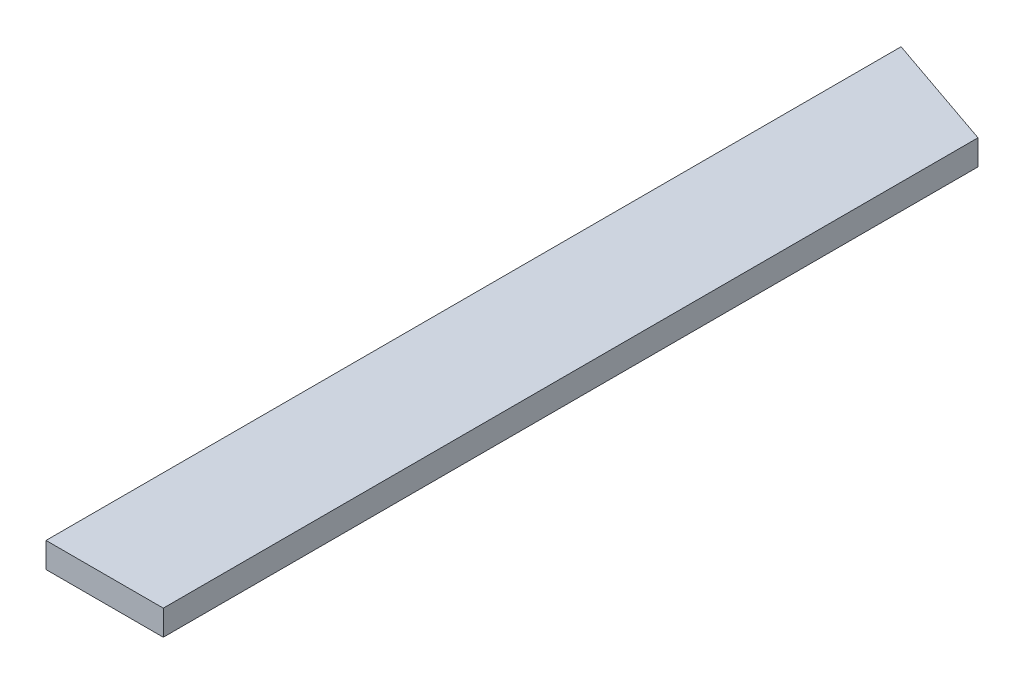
from build123d import *

# Parameters (mm, degrees)
SKETCH1_W           = 590.55
SKETCH1_H           = 4722.60422
BOSS_EXTRUDE1_DEPTH = 127
CUT_EXTRUDE1_DEPTH  = 2384.078676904


with BuildPart() as part:
    # Sketch1 → Boss-Extrude1 (new body)
    with BuildSketch(Plane(origin=(0, 0, 0), x_dir=(1, 0, 0), z_dir=(0, 1, 0))):
        Rectangle(SKETCH1_W, SKETCH1_H)
    extrude(amount=BOSS_EXTRUDE1_DEPTH)

    # Sketch2 → Cut-Extrude1 (cut, through all)
    with BuildSketch(Plane.XZ):
        Polygon((-295.275, -1943.919752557), (-295.275, -2361.30211), (295.275, -2361.30211), (295.275, -1740.577080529), align=None)
    extrude(amount=-CUT_EXTRUDE1_DEPTH, mode=Mode.SUBTRACT)


solid = part.part
